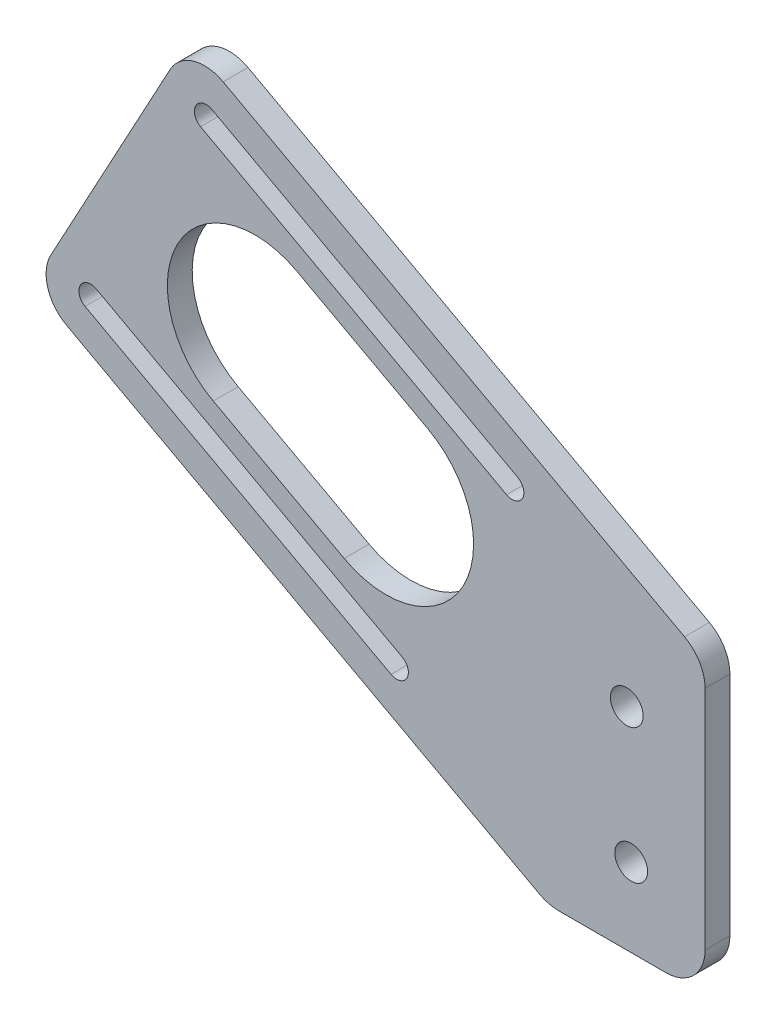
ISO-10303-21;
HEADER;
FILE_DESCRIPTION(('STEP AP214'),'2;1');
FILE_NAME('part.step','',(''),(''),'','','');
FILE_SCHEMA(('AUTOMOTIVE_DESIGN { 1 0 10303 214 1 1 1 1 }'));
ENDSEC;
DATA;
#1=APPLICATION_CONTEXT('core data for automotive mechanical design processes');
#2=APPLICATION_PROTOCOL_DEFINITION('international standard','automotive_design',2000,#1);
#3=PRODUCT_CONTEXT('',#1,'mechanical');
#4=PRODUCT('Part','Part','',(#3));
#5=PRODUCT_RELATED_PRODUCT_CATEGORY('part','',(#4));
#6=PRODUCT_DEFINITION_FORMATION('','',#4);
#7=PRODUCT_DEFINITION_CONTEXT('part definition',#1,'design');
#8=PRODUCT_DEFINITION('design','',#6,#7);
#9=PRODUCT_DEFINITION_SHAPE('','',#8);
#10=(LENGTH_UNIT() NAMED_UNIT(*) SI_UNIT(.MILLI.,.METRE.));
#11=(NAMED_UNIT(*) PLANE_ANGLE_UNIT() SI_UNIT($,.RADIAN.));
#12=(NAMED_UNIT(*) SI_UNIT($,.STERADIAN.) SOLID_ANGLE_UNIT());
#13=UNCERTAINTY_MEASURE_WITH_UNIT(LENGTH_MEASURE(1.E-05),#10,'distance_accuracy_value','');
#14=(GEOMETRIC_REPRESENTATION_CONTEXT(3) GLOBAL_UNCERTAINTY_ASSIGNED_CONTEXT((#13)) GLOBAL_UNIT_ASSIGNED_CONTEXT((#10,
#11,#12)) REPRESENTATION_CONTEXT('',''));
#15=CARTESIAN_POINT('',(0.,0.,0.));
#16=DIRECTION('',(0.,0.,1.));
#17=DIRECTION('',(1.,0.,0.));
#18=AXIS2_PLACEMENT_3D('',#15,#16,#17);
#19=CARTESIAN_POINT('',(0.,0.,3.175));
#20=DIRECTION('',(0.,0.,1.));
#21=DIRECTION('',(1.,0.,0.));
#22=AXIS2_PLACEMENT_3D('',#19,#20,#21);
#23=PLANE('',#22);
#24=CARTESIAN_POINT('',(-53.7276656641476,308.249751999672,3.175));
#25=DIRECTION('',(0.,0.,-1.));
#26=DIRECTION('',(-1.,0.,0.));
#27=AXIS2_PLACEMENT_3D('',#24,#25,#26);
#28=CIRCLE('',#27,1.49999999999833);
#29=CARTESIAN_POINT('',(-54.4419513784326,306.930738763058,3.175));
#30=VERTEX_POINT('',#29);
#31=CARTESIAN_POINT('',(-53.0133799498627,309.568765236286,3.175));
#32=VERTEX_POINT('',#31);
#33=EDGE_CURVE('E243',#30,#32,#28,.T.);
#34=ORIENTED_EDGE('',*,*,#33,.T.);
#35=DIRECTION('',(0.879342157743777,-0.476190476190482,0.));
#36=VECTOR('',#35,1.);
#37=CARTESIAN_POINT('',(-53.0133799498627,309.568765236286,3.175));
#38=LINE('',#37,#36);
#39=CARTESIAN_POINT('',(-13.9266210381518,288.402098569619,3.175));
#40=VERTEX_POINT('',#39);
#41=EDGE_CURVE('E276',#32,#40,#38,.T.);
#42=ORIENTED_EDGE('',*,*,#41,.T.);
#43=CARTESIAN_POINT('',(-14.6409067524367,287.083085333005,3.175));
#44=DIRECTION('',(0.,0.,-1.));
#45=DIRECTION('',(-1.,0.,0.));
#46=AXIS2_PLACEMENT_3D('',#43,#44,#45);
#47=CIRCLE('',#46,1.49999999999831);
#48=CARTESIAN_POINT('',(-15.3551924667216,285.764072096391,3.175));
#49=VERTEX_POINT('',#48);
#50=EDGE_CURVE('E272',#40,#49,#47,.T.);
#51=ORIENTED_EDGE('',*,*,#50,.T.);
#52=DIRECTION('',(0.879342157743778,-0.476190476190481,0.));
#53=VECTOR('',#52,1.);
#54=CARTESIAN_POINT('',(-54.4419513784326,306.930738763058,3.175));
#55=LINE('',#54,#53);
#56=EDGE_CURVE('E270',#30,#49,#55,.T.);
#57=ORIENTED_EDGE('',*,*,#56,.F.);
#58=EDGE_LOOP('',(#34,#42,#51,#57));
#59=FACE_BOUND('',#58,.T.);
#60=CARTESIAN_POINT('',(-47.4844765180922,287.248100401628,3.175));
#61=DIRECTION('',(0.,0.,-1.));
#62=DIRECTION('',(-1.,0.,0.));
#63=AXIS2_PLACEMENT_3D('',#60,#61,#62);
#64=CIRCLE('',#63,11.1999999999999);
#65=CARTESIAN_POINT('',(-52.8178098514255,277.399468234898,3.175));
#66=VERTEX_POINT('',#65);
#67=CARTESIAN_POINT('',(-42.1511431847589,297.096732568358,3.175));
#68=VERTEX_POINT('',#67);
#69=EDGE_CURVE('E311',#66,#68,#64,.T.);
#70=ORIENTED_EDGE('',*,*,#69,.T.);
#71=DIRECTION('',(0.879342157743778,-0.476190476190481,0.));
#72=VECTOR('',#71,1.);
#73=CARTESIAN_POINT('',(-42.1511431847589,297.096732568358,3.175));
#74=LINE('',#73,#72);
#75=CARTESIAN_POINT('',(-25.4301758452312,288.041821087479,3.175));
#76=VERTEX_POINT('',#75);
#77=EDGE_CURVE('E314',#68,#76,#74,.T.);
#78=ORIENTED_EDGE('',*,*,#77,.T.);
#79=CARTESIAN_POINT('',(-30.7635091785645,278.193188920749,3.175));
#80=DIRECTION('',(0.,0.,-1.));
#81=DIRECTION('',(-1.,0.,0.));
#82=AXIS2_PLACEMENT_3D('',#79,#80,#81);
#83=CIRCLE('',#82,11.1999999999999);
#84=CARTESIAN_POINT('',(-36.0968425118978,268.344556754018,3.175));
#85=VERTEX_POINT('',#84);
#86=EDGE_CURVE('E318',#76,#85,#83,.T.);
#87=ORIENTED_EDGE('',*,*,#86,.T.);
#88=DIRECTION('',(0.879342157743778,-0.476190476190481,0.));
#89=VECTOR('',#88,1.);
#90=CARTESIAN_POINT('',(-52.8178098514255,277.399468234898,3.175));
#91=LINE('',#90,#89);
#92=EDGE_CURVE('E321',#66,#85,#91,.T.);
#93=ORIENTED_EDGE('',*,*,#92,.F.);
#94=EDGE_LOOP('',(#70,#78,#87,#93));
#95=FACE_BOUND('',#94,.T.);
#96=CARTESIAN_POINT('',(-1.07552855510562E-13,270.,3.175));
#97=DIRECTION('',(0.,0.,1.));
#98=DIRECTION('',(1.,0.,0.));
#99=AXIS2_PLACEMENT_3D('',#96,#97,#98);
#100=CIRCLE('',#99,2.09500000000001);
#101=CARTESIAN_POINT('',(2.0949999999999,270.,3.175));
#102=VERTEX_POINT('',#101);
#103=EDGE_CURVE('E340',#102,#102,#100,.T.);
#104=ORIENTED_EDGE('',*,*,#103,.F.);
#105=EDGE_LOOP('',(#104));
#106=FACE_BOUND('',#105,.T.);
#107=DIRECTION('',(0.,-1.,0.));
#108=VECTOR('',#107,1.);
#109=CARTESIAN_POINT('',(10.0000000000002,0.,3.175));
#110=LINE('',#109,#108);
#111=CARTESIAN_POINT('',(10.0000000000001,277.021583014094,3.175));
#112=VERTEX_POINT('',#111);
#113=CARTESIAN_POINT('',(10.0000000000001,248.067629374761,3.175));
#114=VERTEX_POINT('',#113);
#115=EDGE_CURVE('E343',#112,#114,#110,.T.);
#116=ORIENTED_EDGE('',*,*,#115,.F.);
#117=CARTESIAN_POINT('',(5.00000000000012,277.021583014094,3.175));
#118=DIRECTION('',(0.,0.,1.));
#119=DIRECTION('',(1.,0.,0.));
#120=AXIS2_PLACEMENT_3D('',#117,#118,#119);
#121=CIRCLE('',#120,5.);
#122=CARTESIAN_POINT('',(7.38095238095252,281.418293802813,3.175));
#123=VERTEX_POINT('',#122);
#124=EDGE_CURVE('E407',#112,#123,#121,.T.);
#125=ORIENTED_EDGE('',*,*,#124,.T.);
#126=DIRECTION('',(-0.879342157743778,0.47619047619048,0.));
#127=VECTOR('',#126,1.);
#128=CARTESIAN_POINT('',(119.51319472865,220.695280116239,3.175));
#129=LINE('',#128,#127);
#130=CARTESIAN_POINT('',(-51.5539510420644,313.333333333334,3.175));
#131=VERTEX_POINT('',#130);
#132=EDGE_CURVE('E347',#123,#131,#129,.T.);
#133=ORIENTED_EDGE('',*,*,#132,.T.);
#134=CARTESIAN_POINT('',(-53.9349034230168,308.936622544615,3.175));
#135=DIRECTION('',(0.,0.,1.));
#136=DIRECTION('',(1.,0.,0.));
#137=AXIS2_PLACEMENT_3D('',#134,#135,#136);
#138=CIRCLE('',#137,5.);
#139=CARTESIAN_POINT('',(-58.3316142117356,311.317574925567,3.175));
#140=VERTEX_POINT('',#139);
#141=EDGE_CURVE('E400',#131,#140,#138,.T.);
#142=ORIENTED_EDGE('',*,*,#141,.T.);
#143=DIRECTION('',(0.47619047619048,0.879342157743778,0.));
#144=VECTOR('',#143,1.);
#145=CARTESIAN_POINT('',(-175.463856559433,95.0190055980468,3.175));
#146=LINE('',#145,#144);
#147=CARTESIAN_POINT('',(-73.569709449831,283.178625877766,3.175));
#148=VERTEX_POINT('',#147);
#149=EDGE_CURVE('E350',#148,#140,#146,.T.);
#150=ORIENTED_EDGE('',*,*,#149,.F.);
#151=CARTESIAN_POINT('',(-69.1729986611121,280.797673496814,3.175));
#152=DIRECTION('',(0.,0.,1.));
#153=DIRECTION('',(1.,0.,0.));
#154=AXIS2_PLACEMENT_3D('',#151,#152,#153);
#155=CIRCLE('',#154,5.);
#156=CARTESIAN_POINT('',(-71.5539510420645,276.400962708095,3.175));
#157=VERTEX_POINT('',#156);
#158=EDGE_CURVE('E402',#148,#157,#155,.T.);
#159=ORIENTED_EDGE('',*,*,#158,.T.);
#160=DIRECTION('',(-0.879342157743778,0.47619047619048,0.));
#161=VECTOR('',#160,1.);
#162=CARTESIAN_POINT('',(99.5131947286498,183.762909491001,3.175));
#163=LINE('',#162,#161);
#164=CARTESIAN_POINT('',(-11.1140450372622,243.670918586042,3.175));
#165=VERTEX_POINT('',#164);
#166=EDGE_CURVE('E353',#165,#157,#163,.T.);
#167=ORIENTED_EDGE('',*,*,#166,.F.);
#168=CARTESIAN_POINT('',(-8.73309265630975,248.067629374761,3.175));
#169=DIRECTION('',(0.,0.,1.));
#170=DIRECTION('',(1.,0.,0.));
#171=AXIS2_PLACEMENT_3D('',#168,#169,#170);
#172=CIRCLE('',#171,5.);
#173=CARTESIAN_POINT('',(-8.73309265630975,243.067629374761,3.175));
#174=VERTEX_POINT('',#173);
#175=EDGE_CURVE('E102',#165,#174,#172,.T.);
#176=ORIENTED_EDGE('',*,*,#175,.T.);
#177=DIRECTION('',(-1.,0.,0.));
#178=VECTOR('',#177,1.);
#179=CARTESIAN_POINT('',(0.,243.067629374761,3.175));
#180=LINE('',#179,#178);
#181=CARTESIAN_POINT('',(5.00000000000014,243.067629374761,3.175));
#182=VERTEX_POINT('',#181);
#183=EDGE_CURVE('E356',#182,#174,#180,.T.);
#184=ORIENTED_EDGE('',*,*,#183,.F.);
#185=CARTESIAN_POINT('',(5.00000000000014,248.067629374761,3.175));
#186=DIRECTION('',(0.,0.,1.));
#187=DIRECTION('',(1.,0.,0.));
#188=AXIS2_PLACEMENT_3D('',#185,#186,#187);
#189=CIRCLE('',#188,5.);
#190=EDGE_CURVE('E405',#182,#114,#189,.T.);
#191=ORIENTED_EDGE('',*,*,#190,.T.);
#192=EDGE_LOOP('',(#116,#125,#133,#142,#150,#159,#167,#176,#184,#191));
#193=FACE_BOUND('',#192,.T.);
#194=CARTESIAN_POINT('',(0.569659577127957,253.067629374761,3.175));
#195=DIRECTION('',(0.,0.,1.));
#196=DIRECTION('',(1.,0.,0.));
#197=AXIS2_PLACEMENT_3D('',#194,#195,#196);
#198=CIRCLE('',#197,2.095);
#199=CARTESIAN_POINT('',(2.66465957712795,253.067629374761,3.175));
#200=VERTEX_POINT('',#199);
#201=EDGE_CURVE('E358',#200,#200,#198,.T.);
#202=ORIENTED_EDGE('',*,*,#201,.F.);
#203=EDGE_LOOP('',(#202));
#204=FACE_BOUND('',#203,.T.);
#205=DIRECTION('',(0.879342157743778,-0.476190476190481,0.));
#206=VECTOR('',#205,1.);
#207=CARTESIAN_POINT('',(-69.1987993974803,279.680469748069,3.175));
#208=LINE('',#207,#206);
#209=CARTESIAN_POINT('',(-69.1987993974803,279.680469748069,3.175));
#210=VERTEX_POINT('',#209);
#211=CARTESIAN_POINT('',(-30.1120404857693,258.513803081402,3.175));
#212=VERTEX_POINT('',#211);
#213=EDGE_CURVE('E308',#210,#212,#208,.T.);
#214=ORIENTED_EDGE('',*,*,#213,.F.);
#215=CARTESIAN_POINT('',(-68.4845136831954,280.999482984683,3.175));
#216=DIRECTION('',(0.,0.,1.));
#217=DIRECTION('',(1.,0.,0.));
#218=AXIS2_PLACEMENT_3D('',#215,#216,#217);
#219=CIRCLE('',#218,1.49999999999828);
#220=CARTESIAN_POINT('',(-67.7702279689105,282.318496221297,3.175));
#221=VERTEX_POINT('',#220);
#222=EDGE_CURVE('E295',#221,#210,#219,.T.);
#223=ORIENTED_EDGE('',*,*,#222,.F.);
#224=DIRECTION('',(0.879342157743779,-0.476190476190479,0.));
#225=VECTOR('',#224,1.);
#226=CARTESIAN_POINT('',(-67.7702279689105,282.318496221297,3.175));
#227=LINE('',#226,#225);
#228=CARTESIAN_POINT('',(-28.6834690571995,261.15182955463,3.175));
#229=VERTEX_POINT('',#228);
#230=EDGE_CURVE('E290',#221,#229,#227,.T.);
#231=ORIENTED_EDGE('',*,*,#230,.T.);
#232=CARTESIAN_POINT('',(-29.3977547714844,259.832816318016,3.175));
#233=DIRECTION('',(0.,0.,1.));
#234=DIRECTION('',(1.,0.,0.));
#235=AXIS2_PLACEMENT_3D('',#232,#233,#234);
#236=CIRCLE('',#235,1.49999999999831);
#237=EDGE_CURVE('E305',#212,#229,#236,.T.);
#238=ORIENTED_EDGE('',*,*,#237,.F.);
#239=EDGE_LOOP('',(#214,#223,#231,#238));
#240=FACE_BOUND('',#239,.T.);
#241=ADVANCED_FACE('F87',(#59,#95,#106,#193,#204,#240),#23,.T.);
#242=CARTESIAN_POINT('',(0.,0.,0.));
#243=DIRECTION('',(0.,0.,1.));
#244=DIRECTION('',(1.,0.,0.));
#245=AXIS2_PLACEMENT_3D('',#242,#243,#244);
#246=PLANE('',#245);
#247=CARTESIAN_POINT('',(0.569659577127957,253.067629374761,0.));
#248=DIRECTION('',(0.,0.,1.));
#249=DIRECTION('',(1.,0.,0.));
#250=AXIS2_PLACEMENT_3D('',#247,#248,#249);
#251=CIRCLE('',#250,2.095);
#252=CARTESIAN_POINT('',(2.66465957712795,253.067629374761,0.));
#253=VERTEX_POINT('',#252);
#254=EDGE_CURVE('E344',#253,#253,#251,.T.);
#255=ORIENTED_EDGE('',*,*,#254,.T.);
#256=EDGE_LOOP('',(#255));
#257=FACE_BOUND('',#256,.T.);
#258=DIRECTION('',(-0.879342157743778,0.47619047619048,0.));
#259=VECTOR('',#258,1.);
#260=CARTESIAN_POINT('',(119.51319472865,220.695280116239,0.));
#261=LINE('',#260,#259);
#262=CARTESIAN_POINT('',(7.38095238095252,281.418293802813,0.));
#263=VERTEX_POINT('',#262);
#264=CARTESIAN_POINT('',(-51.5539510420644,313.333333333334,0.));
#265=VERTEX_POINT('',#264);
#266=EDGE_CURVE('E367',#263,#265,#261,.T.);
#267=ORIENTED_EDGE('',*,*,#266,.F.);
#268=CARTESIAN_POINT('',(5.00000000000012,277.021583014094,0.));
#269=DIRECTION('',(0.,0.,1.));
#270=DIRECTION('',(1.,0.,0.));
#271=AXIS2_PLACEMENT_3D('',#268,#269,#270);
#272=CIRCLE('',#271,5.);
#273=CARTESIAN_POINT('',(10.0000000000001,277.021583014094,0.));
#274=VERTEX_POINT('',#273);
#275=EDGE_CURVE('E393',#263,#274,#272,.F.);
#276=ORIENTED_EDGE('',*,*,#275,.T.);
#277=DIRECTION('',(0.,-1.,0.));
#278=VECTOR('',#277,1.);
#279=CARTESIAN_POINT('',(10.0000000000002,0.,0.));
#280=LINE('',#279,#278);
#281=CARTESIAN_POINT('',(10.0000000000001,248.067629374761,0.));
#282=VERTEX_POINT('',#281);
#283=EDGE_CURVE('E364',#274,#282,#280,.T.);
#284=ORIENTED_EDGE('',*,*,#283,.T.);
#285=CARTESIAN_POINT('',(5.00000000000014,248.067629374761,0.));
#286=DIRECTION('',(0.,0.,1.));
#287=DIRECTION('',(1.,0.,0.));
#288=AXIS2_PLACEMENT_3D('',#285,#286,#287);
#289=CIRCLE('',#288,5.);
#290=CARTESIAN_POINT('',(5.00000000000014,243.067629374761,0.));
#291=VERTEX_POINT('',#290);
#292=EDGE_CURVE('E391',#282,#291,#289,.F.);
#293=ORIENTED_EDGE('',*,*,#292,.T.);
#294=DIRECTION('',(-1.,0.,0.));
#295=VECTOR('',#294,1.);
#296=CARTESIAN_POINT('',(0.,243.067629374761,0.));
#297=LINE('',#296,#295);
#298=CARTESIAN_POINT('',(-8.73309265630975,243.067629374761,0.));
#299=VERTEX_POINT('',#298);
#300=EDGE_CURVE('E376',#291,#299,#297,.T.);
#301=ORIENTED_EDGE('',*,*,#300,.T.);
#302=CARTESIAN_POINT('',(-8.73309265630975,248.067629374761,0.));
#303=DIRECTION('',(0.,0.,1.));
#304=DIRECTION('',(1.,0.,0.));
#305=AXIS2_PLACEMENT_3D('',#302,#303,#304);
#306=CIRCLE('',#305,5.);
#307=CARTESIAN_POINT('',(-11.1140450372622,243.670918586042,0.));
#308=VERTEX_POINT('',#307);
#309=EDGE_CURVE('E389',#299,#308,#306,.F.);
#310=ORIENTED_EDGE('',*,*,#309,.T.);
#311=DIRECTION('',(-0.879342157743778,0.47619047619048,0.));
#312=VECTOR('',#311,1.);
#313=CARTESIAN_POINT('',(99.5131947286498,183.762909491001,0.));
#314=LINE('',#313,#312);
#315=CARTESIAN_POINT('',(-71.5539510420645,276.400962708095,0.));
#316=VERTEX_POINT('',#315);
#317=EDGE_CURVE('E373',#308,#316,#314,.T.);
#318=ORIENTED_EDGE('',*,*,#317,.T.);
#319=CARTESIAN_POINT('',(-69.1729986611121,280.797673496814,0.));
#320=DIRECTION('',(0.,0.,1.));
#321=DIRECTION('',(1.,0.,0.));
#322=AXIS2_PLACEMENT_3D('',#319,#320,#321);
#323=CIRCLE('',#322,5.);
#324=CARTESIAN_POINT('',(-73.569709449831,283.178625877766,0.));
#325=VERTEX_POINT('',#324);
#326=EDGE_CURVE('E387',#316,#325,#323,.F.);
#327=ORIENTED_EDGE('',*,*,#326,.T.);
#328=DIRECTION('',(0.47619047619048,0.879342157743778,0.));
#329=VECTOR('',#328,1.);
#330=CARTESIAN_POINT('',(-175.463856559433,95.0190055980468,0.));
#331=LINE('',#330,#329);
#332=CARTESIAN_POINT('',(-58.3316142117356,311.317574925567,0.));
#333=VERTEX_POINT('',#332);
#334=EDGE_CURVE('E370',#325,#333,#331,.T.);
#335=ORIENTED_EDGE('',*,*,#334,.T.);
#336=CARTESIAN_POINT('',(-53.9349034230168,308.936622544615,0.));
#337=DIRECTION('',(0.,0.,1.));
#338=DIRECTION('',(1.,0.,0.));
#339=AXIS2_PLACEMENT_3D('',#336,#337,#338);
#340=CIRCLE('',#339,5.);
#341=EDGE_CURVE('E385',#333,#265,#340,.F.);
#342=ORIENTED_EDGE('',*,*,#341,.T.);
#343=EDGE_LOOP('',(#267,#276,#284,#293,#301,#310,#318,#327,#335,#342));
#344=FACE_BOUND('',#343,.T.);
#345=CARTESIAN_POINT('',(-1.07552855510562E-13,270.,0.));
#346=DIRECTION('',(0.,0.,1.));
#347=DIRECTION('',(1.,0.,0.));
#348=AXIS2_PLACEMENT_3D('',#345,#346,#347);
#349=CIRCLE('',#348,2.09500000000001);
#350=CARTESIAN_POINT('',(2.0949999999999,270.,0.));
#351=VERTEX_POINT('',#350);
#352=EDGE_CURVE('E333',#351,#351,#349,.T.);
#353=ORIENTED_EDGE('',*,*,#352,.T.);
#354=EDGE_LOOP('',(#353));
#355=FACE_BOUND('',#354,.T.);
#356=DIRECTION('',(0.879342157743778,-0.476190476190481,0.));
#357=VECTOR('',#356,1.);
#358=CARTESIAN_POINT('',(-42.1511431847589,297.096732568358,0.));
#359=LINE('',#358,#357);
#360=CARTESIAN_POINT('',(-42.1511431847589,297.096732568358,0.));
#361=VERTEX_POINT('',#360);
#362=CARTESIAN_POINT('',(-25.4301758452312,288.041821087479,0.));
#363=VERTEX_POINT('',#362);
#364=EDGE_CURVE('E265',#361,#363,#359,.T.);
#365=ORIENTED_EDGE('',*,*,#364,.F.);
#366=CARTESIAN_POINT('',(-47.4844765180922,287.248100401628,0.));
#367=DIRECTION('',(0.,0.,-1.));
#368=DIRECTION('',(-1.,0.,0.));
#369=AXIS2_PLACEMENT_3D('',#366,#367,#368);
#370=CIRCLE('',#369,11.1999999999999);
#371=CARTESIAN_POINT('',(-52.8178098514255,277.399468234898,0.));
#372=VERTEX_POINT('',#371);
#373=EDGE_CURVE('E263',#372,#361,#370,.T.);
#374=ORIENTED_EDGE('',*,*,#373,.F.);
#375=DIRECTION('',(0.879342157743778,-0.476190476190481,0.));
#376=VECTOR('',#375,1.);
#377=CARTESIAN_POINT('',(-52.8178098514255,277.399468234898,0.));
#378=LINE('',#377,#376);
#379=CARTESIAN_POINT('',(-36.0968425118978,268.344556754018,0.));
#380=VERTEX_POINT('',#379);
#381=EDGE_CURVE('E315',#372,#380,#378,.T.);
#382=ORIENTED_EDGE('',*,*,#381,.T.);
#383=CARTESIAN_POINT('',(-30.7635091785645,278.193188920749,0.));
#384=DIRECTION('',(0.,0.,-1.));
#385=DIRECTION('',(-1.,0.,0.));
#386=AXIS2_PLACEMENT_3D('',#383,#384,#385);
#387=CIRCLE('',#386,11.1999999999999);
#388=EDGE_CURVE('E326',#363,#380,#387,.T.);
#389=ORIENTED_EDGE('',*,*,#388,.F.);
#390=EDGE_LOOP('',(#365,#374,#382,#389));
#391=FACE_BOUND('',#390,.T.);
#392=DIRECTION('',(0.879342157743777,-0.476190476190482,0.));
#393=VECTOR('',#392,1.);
#394=CARTESIAN_POINT('',(-53.0133799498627,309.568765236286,0.));
#395=LINE('',#394,#393);
#396=CARTESIAN_POINT('',(-53.0133799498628,309.568765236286,0.));
#397=VERTEX_POINT('',#396);
#398=CARTESIAN_POINT('',(-13.9266210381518,288.402098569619,0.));
#399=VERTEX_POINT('',#398);
#400=EDGE_CURVE('E262',#397,#399,#395,.T.);
#401=ORIENTED_EDGE('',*,*,#400,.F.);
#402=CARTESIAN_POINT('',(-53.7276656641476,308.249751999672,0.));
#403=DIRECTION('',(0.,0.,-1.));
#404=DIRECTION('',(-1.,0.,0.));
#405=AXIS2_PLACEMENT_3D('',#402,#403,#404);
#406=CIRCLE('',#405,1.49999999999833);
#407=CARTESIAN_POINT('',(-54.4419513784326,306.930738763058,0.));
#408=VERTEX_POINT('',#407);
#409=EDGE_CURVE('E240',#408,#397,#406,.T.);
#410=ORIENTED_EDGE('',*,*,#409,.F.);
#411=DIRECTION('',(0.879342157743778,-0.476190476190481,0.));
#412=VECTOR('',#411,1.);
#413=CARTESIAN_POINT('',(-54.4419513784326,306.930738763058,0.));
#414=LINE('',#413,#412);
#415=CARTESIAN_POINT('',(-15.3551924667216,285.764072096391,0.));
#416=VERTEX_POINT('',#415);
#417=EDGE_CURVE('E250',#408,#416,#414,.T.);
#418=ORIENTED_EDGE('',*,*,#417,.T.);
#419=CARTESIAN_POINT('',(-14.6409067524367,287.083085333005,0.));
#420=DIRECTION('',(0.,0.,-1.));
#421=DIRECTION('',(-1.,0.,0.));
#422=AXIS2_PLACEMENT_3D('',#419,#420,#421);
#423=CIRCLE('',#422,1.49999999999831);
#424=EDGE_CURVE('E256',#399,#416,#423,.T.);
#425=ORIENTED_EDGE('',*,*,#424,.F.);
#426=EDGE_LOOP('',(#401,#410,#418,#425));
#427=FACE_BOUND('',#426,.T.);
#428=CARTESIAN_POINT('',(-68.4845136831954,280.999482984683,0.));
#429=DIRECTION('',(0.,0.,1.));
#430=DIRECTION('',(1.,0.,0.));
#431=AXIS2_PLACEMENT_3D('',#428,#429,#430);
#432=CIRCLE('',#431,1.49999999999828);
#433=CARTESIAN_POINT('',(-67.7702279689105,282.318496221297,0.));
#434=VERTEX_POINT('',#433);
#435=CARTESIAN_POINT('',(-69.1987993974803,279.680469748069,0.));
#436=VERTEX_POINT('',#435);
#437=EDGE_CURVE('E247',#434,#436,#432,.T.);
#438=ORIENTED_EDGE('',*,*,#437,.T.);
#439=DIRECTION('',(0.879342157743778,-0.476190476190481,0.));
#440=VECTOR('',#439,1.);
#441=CARTESIAN_POINT('',(-69.1987993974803,279.680469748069,0.));
#442=LINE('',#441,#440);
#443=CARTESIAN_POINT('',(-30.1120404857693,258.513803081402,0.));
#444=VERTEX_POINT('',#443);
#445=EDGE_CURVE('E298',#436,#444,#442,.T.);
#446=ORIENTED_EDGE('',*,*,#445,.T.);
#447=CARTESIAN_POINT('',(-29.3977547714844,259.832816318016,0.));
#448=DIRECTION('',(0.,0.,1.));
#449=DIRECTION('',(1.,0.,0.));
#450=AXIS2_PLACEMENT_3D('',#447,#448,#449);
#451=CIRCLE('',#450,1.49999999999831);
#452=CARTESIAN_POINT('',(-28.6834690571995,261.15182955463,0.));
#453=VERTEX_POINT('',#452);
#454=EDGE_CURVE('E294',#444,#453,#451,.T.);
#455=ORIENTED_EDGE('',*,*,#454,.T.);
#456=DIRECTION('',(0.879342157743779,-0.476190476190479,0.));
#457=VECTOR('',#456,1.);
#458=CARTESIAN_POINT('',(-67.7702279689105,282.318496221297,0.));
#459=LINE('',#458,#457);
#460=EDGE_CURVE('E291',#434,#453,#459,.T.);
#461=ORIENTED_EDGE('',*,*,#460,.F.);
#462=EDGE_LOOP('',(#438,#446,#455,#461));
#463=FACE_BOUND('',#462,.T.);
#464=ADVANCED_FACE('F259',(#257,#344,#355,#391,#427,#463),#246,.F.);
#465=CARTESIAN_POINT('',(10.0000000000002,0.,3.175));
#466=DIRECTION('',(1.,0.,0.));
#467=DIRECTION('',(0.,1.,0.));
#468=AXIS2_PLACEMENT_3D('',#465,#466,#467);
#469=PLANE('',#468);
#470=ORIENTED_EDGE('',*,*,#283,.F.);
#471=DIRECTION('',(0.,0.,-1.));
#472=VECTOR('',#471,1.);
#473=CARTESIAN_POINT('',(10.0000000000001,277.021583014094,3.175));
#474=LINE('',#473,#472);
#475=EDGE_CURVE('E398',#274,#112,#474,.F.);
#476=ORIENTED_EDGE('',*,*,#475,.T.);
#477=ORIENTED_EDGE('',*,*,#115,.T.);
#478=DIRECTION('',(0.,0.,-1.));
#479=VECTOR('',#478,1.);
#480=CARTESIAN_POINT('',(10.0000000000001,248.067629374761,3.175));
#481=LINE('',#480,#479);
#482=EDGE_CURVE('E395',#114,#282,#481,.T.);
#483=ORIENTED_EDGE('',*,*,#482,.T.);
#484=EDGE_LOOP('',(#470,#476,#477,#483));
#485=FACE_BOUND('',#484,.T.);
#486=ADVANCED_FACE('F449',(#485),#469,.T.);
#487=CARTESIAN_POINT('',(119.51319472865,220.695280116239,3.175));
#488=DIRECTION('',(-0.47619047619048,-0.879342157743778,0.));
#489=DIRECTION('',(0.879342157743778,-0.47619047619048,0.));
#490=AXIS2_PLACEMENT_3D('',#487,#488,#489);
#491=PLANE('',#490);
#492=ORIENTED_EDGE('',*,*,#132,.F.);
#493=DIRECTION('',(0.,0.,-1.));
#494=VECTOR('',#493,1.);
#495=CARTESIAN_POINT('',(7.38095238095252,281.418293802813,0.));
#496=LINE('',#495,#494);
#497=EDGE_CURVE('E382',#123,#263,#496,.T.);
#498=ORIENTED_EDGE('',*,*,#497,.T.);
#499=ORIENTED_EDGE('',*,*,#266,.T.);
#500=DIRECTION('',(0.,0.,-1.));
#501=VECTOR('',#500,1.);
#502=CARTESIAN_POINT('',(-51.5539510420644,313.333333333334,3.175));
#503=LINE('',#502,#501);
#504=EDGE_CURVE('E361',#265,#131,#503,.F.);
#505=ORIENTED_EDGE('',*,*,#504,.T.);
#506=EDGE_LOOP('',(#492,#498,#499,#505));
#507=FACE_BOUND('',#506,.T.);
#508=ADVANCED_FACE('F457',(#507),#491,.F.);
#509=CARTESIAN_POINT('',(-175.463856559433,95.0190055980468,3.175));
#510=DIRECTION('',(-0.879342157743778,0.47619047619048,0.));
#511=DIRECTION('',(-0.47619047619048,-0.879342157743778,0.));
#512=AXIS2_PLACEMENT_3D('',#509,#510,#511);
#513=PLANE('',#512);
#514=ORIENTED_EDGE('',*,*,#334,.F.);
#515=DIRECTION('',(0.,0.,-1.));
#516=VECTOR('',#515,1.);
#517=CARTESIAN_POINT('',(-73.5697094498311,283.178625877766,3.175));
#518=LINE('',#517,#516);
#519=EDGE_CURVE('E12',#325,#148,#518,.F.);
#520=ORIENTED_EDGE('',*,*,#519,.T.);
#521=ORIENTED_EDGE('',*,*,#149,.T.);
#522=DIRECTION('',(0.,0.,-1.));
#523=VECTOR('',#522,1.);
#524=CARTESIAN_POINT('',(-58.3316142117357,311.317574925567,0.));
#525=LINE('',#524,#523);
#526=EDGE_CURVE('E95',#140,#333,#525,.T.);
#527=ORIENTED_EDGE('',*,*,#526,.T.);
#528=EDGE_LOOP('',(#514,#520,#521,#527));
#529=FACE_BOUND('',#528,.T.);
#530=ADVANCED_FACE('F421',(#529),#513,.T.);
#531=CARTESIAN_POINT('',(99.5131947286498,183.762909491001,3.175));
#532=DIRECTION('',(-0.47619047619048,-0.879342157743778,0.));
#533=DIRECTION('',(0.879342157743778,-0.47619047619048,0.));
#534=AXIS2_PLACEMENT_3D('',#531,#532,#533);
#535=PLANE('',#534);
#536=ORIENTED_EDGE('',*,*,#317,.F.);
#537=DIRECTION('',(0.,0.,-1.));
#538=VECTOR('',#537,1.);
#539=CARTESIAN_POINT('',(-11.1140450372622,243.670918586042,3.175));
#540=LINE('',#539,#538);
#541=EDGE_CURVE('E416',#308,#165,#540,.F.);
#542=ORIENTED_EDGE('',*,*,#541,.T.);
#543=ORIENTED_EDGE('',*,*,#166,.T.);
#544=DIRECTION('',(0.,0.,-1.));
#545=VECTOR('',#544,1.);
#546=CARTESIAN_POINT('',(-71.5539510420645,276.400962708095,3.175));
#547=LINE('',#546,#545);
#548=EDGE_CURVE('E413',#157,#316,#547,.T.);
#549=ORIENTED_EDGE('',*,*,#548,.T.);
#550=EDGE_LOOP('',(#536,#542,#543,#549));
#551=FACE_BOUND('',#550,.T.);
#552=ADVANCED_FACE('F435',(#551),#535,.T.);
#553=CARTESIAN_POINT('',(0.,243.067629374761,3.175));
#554=DIRECTION('',(0.,-1.,0.));
#555=DIRECTION('',(0.,0.,-1.));
#556=AXIS2_PLACEMENT_3D('',#553,#554,#555);
#557=PLANE('',#556);
#558=ORIENTED_EDGE('',*,*,#300,.F.);
#559=DIRECTION('',(0.,0.,-1.));
#560=VECTOR('',#559,1.);
#561=CARTESIAN_POINT('',(5.00000000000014,243.067629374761,3.175));
#562=LINE('',#561,#560);
#563=EDGE_CURVE('E109',#291,#182,#562,.F.);
#564=ORIENTED_EDGE('',*,*,#563,.T.);
#565=ORIENTED_EDGE('',*,*,#183,.T.);
#566=DIRECTION('',(0.,0.,-1.));
#567=VECTOR('',#566,1.);
#568=CARTESIAN_POINT('',(-8.73309265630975,243.067629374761,3.175));
#569=LINE('',#568,#567);
#570=EDGE_CURVE('E409',#174,#299,#569,.T.);
#571=ORIENTED_EDGE('',*,*,#570,.T.);
#572=EDGE_LOOP('',(#558,#564,#565,#571));
#573=FACE_BOUND('',#572,.T.);
#574=ADVANCED_FACE('F442',(#573),#557,.T.);
#575=CARTESIAN_POINT('',(-1.07552855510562E-13,270.,3.175));
#576=DIRECTION('',(0.,0.,-1.));
#577=DIRECTION('',(-1.,0.,0.));
#578=AXIS2_PLACEMENT_3D('',#575,#576,#577);
#579=CYLINDRICAL_SURFACE('',#578,2.09500000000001);
#580=ORIENTED_EDGE('',*,*,#103,.T.);
#581=EDGE_LOOP('',(#580));
#582=FACE_BOUND('',#581,.T.);
#583=ORIENTED_EDGE('',*,*,#352,.F.);
#584=EDGE_LOOP('',(#583));
#585=FACE_BOUND('',#584,.T.);
#586=ADVANCED_FACE('F480',(#582,#585),#579,.F.);
#587=CARTESIAN_POINT('',(0.569659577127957,253.067629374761,3.175));
#588=DIRECTION('',(0.,0.,-1.));
#589=DIRECTION('',(-1.,0.,0.));
#590=AXIS2_PLACEMENT_3D('',#587,#588,#589);
#591=CYLINDRICAL_SURFACE('',#590,2.095);
#592=ORIENTED_EDGE('',*,*,#201,.T.);
#593=EDGE_LOOP('',(#592));
#594=FACE_BOUND('',#593,.T.);
#595=ORIENTED_EDGE('',*,*,#254,.F.);
#596=EDGE_LOOP('',(#595));
#597=FACE_BOUND('',#596,.T.);
#598=ADVANCED_FACE('F477',(#594,#597),#591,.F.);
#599=CARTESIAN_POINT('',(-47.4844765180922,287.248100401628,3.175));
#600=DIRECTION('',(0.,0.,-1.));
#601=DIRECTION('',(-1.,0.,0.));
#602=AXIS2_PLACEMENT_3D('',#599,#600,#601);
#603=CYLINDRICAL_SURFACE('',#602,11.1999999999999);
#604=ORIENTED_EDGE('',*,*,#373,.T.);
#605=DIRECTION('',(0.,0.,-1.));
#606=VECTOR('',#605,1.);
#607=CARTESIAN_POINT('',(-42.1511431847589,297.096732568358,3.175));
#608=LINE('',#607,#606);
#609=EDGE_CURVE('E322',#68,#361,#608,.T.);
#610=ORIENTED_EDGE('',*,*,#609,.F.);
#611=ORIENTED_EDGE('',*,*,#69,.F.);
#612=DIRECTION('',(0.,0.,-1.));
#613=VECTOR('',#612,1.);
#614=CARTESIAN_POINT('',(-52.8178098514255,277.399468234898,3.175));
#615=LINE('',#614,#613);
#616=EDGE_CURVE('E331',#66,#372,#615,.T.);
#617=ORIENTED_EDGE('',*,*,#616,.T.);
#618=EDGE_LOOP('',(#604,#610,#611,#617));
#619=FACE_BOUND('',#618,.T.);
#620=ADVANCED_FACE('F474',(#619),#603,.F.);
#621=CARTESIAN_POINT('',(-52.8178098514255,277.399468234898,3.175));
#622=DIRECTION('',(0.476190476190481,0.879342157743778,0.));
#623=DIRECTION('',(-0.879342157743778,0.476190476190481,0.));
#624=AXIS2_PLACEMENT_3D('',#621,#622,#623);
#625=PLANE('',#624);
#626=ORIENTED_EDGE('',*,*,#381,.F.);
#627=ORIENTED_EDGE('',*,*,#616,.F.);
#628=ORIENTED_EDGE('',*,*,#92,.T.);
#629=DIRECTION('',(0.,0.,-1.));
#630=VECTOR('',#629,1.);
#631=CARTESIAN_POINT('',(-36.0968425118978,268.344556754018,3.175));
#632=LINE('',#631,#630);
#633=EDGE_CURVE('E334',#85,#380,#632,.T.);
#634=ORIENTED_EDGE('',*,*,#633,.T.);
#635=EDGE_LOOP('',(#626,#627,#628,#634));
#636=FACE_BOUND('',#635,.T.);
#637=ADVANCED_FACE('F608',(#636),#625,.T.);
#638=CARTESIAN_POINT('',(-30.7635091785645,278.193188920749,3.175));
#639=DIRECTION('',(0.,0.,-1.));
#640=DIRECTION('',(-1.,0.,0.));
#641=AXIS2_PLACEMENT_3D('',#638,#639,#640);
#642=CYLINDRICAL_SURFACE('',#641,11.1999999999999);
#643=ORIENTED_EDGE('',*,*,#388,.T.);
#644=ORIENTED_EDGE('',*,*,#633,.F.);
#645=ORIENTED_EDGE('',*,*,#86,.F.);
#646=DIRECTION('',(0.,0.,-1.));
#647=VECTOR('',#646,1.);
#648=CARTESIAN_POINT('',(-25.4301758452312,288.041821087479,3.175));
#649=LINE('',#648,#647);
#650=EDGE_CURVE('E336',#76,#363,#649,.T.);
#651=ORIENTED_EDGE('',*,*,#650,.T.);
#652=EDGE_LOOP('',(#643,#644,#645,#651));
#653=FACE_BOUND('',#652,.T.);
#654=ADVANCED_FACE('F600',(#653),#642,.F.);
#655=CARTESIAN_POINT('',(-42.1511431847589,297.096732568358,3.175));
#656=DIRECTION('',(0.476190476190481,0.879342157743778,0.));
#657=DIRECTION('',(-0.879342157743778,0.476190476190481,0.));
#658=AXIS2_PLACEMENT_3D('',#655,#656,#657);
#659=PLANE('',#658);
#660=ORIENTED_EDGE('',*,*,#364,.T.);
#661=ORIENTED_EDGE('',*,*,#650,.F.);
#662=ORIENTED_EDGE('',*,*,#77,.F.);
#663=ORIENTED_EDGE('',*,*,#609,.T.);
#664=EDGE_LOOP('',(#660,#661,#662,#663));
#665=FACE_BOUND('',#664,.T.);
#666=ADVANCED_FACE('F592',(#665),#659,.F.);
#667=CARTESIAN_POINT('',(-53.7276656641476,308.249751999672,3.175));
#668=DIRECTION('',(0.,0.,-1.));
#669=DIRECTION('',(-1.,0.,0.));
#670=AXIS2_PLACEMENT_3D('',#667,#668,#669);
#671=CYLINDRICAL_SURFACE('',#670,1.49999999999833);
#672=ORIENTED_EDGE('',*,*,#409,.T.);
#673=DIRECTION('',(0.,0.,-1.));
#674=VECTOR('',#673,1.);
#675=CARTESIAN_POINT('',(-53.0133799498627,309.568765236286,3.175));
#676=LINE('',#675,#674);
#677=EDGE_CURVE('E273',#32,#397,#676,.T.);
#678=ORIENTED_EDGE('',*,*,#677,.F.);
#679=ORIENTED_EDGE('',*,*,#33,.F.);
#680=DIRECTION('',(0.,0.,-1.));
#681=VECTOR('',#680,1.);
#682=CARTESIAN_POINT('',(-54.4419513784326,306.930738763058,3.175));
#683=LINE('',#682,#681);
#684=EDGE_CURVE('E236',#30,#408,#683,.T.);
#685=ORIENTED_EDGE('',*,*,#684,.T.);
#686=EDGE_LOOP('',(#672,#678,#679,#685));
#687=FACE_BOUND('',#686,.T.);
#688=ADVANCED_FACE('F238',(#687),#671,.F.);
#689=CARTESIAN_POINT('',(-54.4419513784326,306.930738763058,3.175));
#690=DIRECTION('',(0.476190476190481,0.879342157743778,0.));
#691=DIRECTION('',(-0.879342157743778,0.476190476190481,0.));
#692=AXIS2_PLACEMENT_3D('',#689,#690,#691);
#693=PLANE('',#692);
#694=ORIENTED_EDGE('',*,*,#417,.F.);
#695=ORIENTED_EDGE('',*,*,#684,.F.);
#696=ORIENTED_EDGE('',*,*,#56,.T.);
#697=DIRECTION('',(0.,0.,-1.));
#698=VECTOR('',#697,1.);
#699=CARTESIAN_POINT('',(-15.3551924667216,285.764072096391,3.175));
#700=LINE('',#699,#698);
#701=EDGE_CURVE('E246',#49,#416,#700,.T.);
#702=ORIENTED_EDGE('',*,*,#701,.T.);
#703=EDGE_LOOP('',(#694,#695,#696,#702));
#704=FACE_BOUND('',#703,.T.);
#705=ADVANCED_FACE('F251',(#704),#693,.T.);
#706=CARTESIAN_POINT('',(-14.6409067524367,287.083085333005,3.175));
#707=DIRECTION('',(0.,0.,-1.));
#708=DIRECTION('',(-1.,0.,0.));
#709=AXIS2_PLACEMENT_3D('',#706,#707,#708);
#710=CYLINDRICAL_SURFACE('',#709,1.49999999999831);
#711=ORIENTED_EDGE('',*,*,#424,.T.);
#712=ORIENTED_EDGE('',*,*,#701,.F.);
#713=ORIENTED_EDGE('',*,*,#50,.F.);
#714=DIRECTION('',(0.,0.,-1.));
#715=VECTOR('',#714,1.);
#716=CARTESIAN_POINT('',(-13.9266210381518,288.402098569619,3.175));
#717=LINE('',#716,#715);
#718=EDGE_CURVE('E719',#40,#399,#717,.T.);
#719=ORIENTED_EDGE('',*,*,#718,.T.);
#720=EDGE_LOOP('',(#711,#712,#713,#719));
#721=FACE_BOUND('',#720,.T.);
#722=ADVANCED_FACE('F568',(#721),#710,.F.);
#723=CARTESIAN_POINT('',(-53.0133799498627,309.568765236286,3.175));
#724=DIRECTION('',(0.476190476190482,0.879342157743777,0.));
#725=DIRECTION('',(-0.879342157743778,0.476190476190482,0.));
#726=AXIS2_PLACEMENT_3D('',#723,#724,#725);
#727=PLANE('',#726);
#728=ORIENTED_EDGE('',*,*,#400,.T.);
#729=ORIENTED_EDGE('',*,*,#718,.F.);
#730=ORIENTED_EDGE('',*,*,#41,.F.);
#731=ORIENTED_EDGE('',*,*,#677,.T.);
#732=EDGE_LOOP('',(#728,#729,#730,#731));
#733=FACE_BOUND('',#732,.T.);
#734=ADVANCED_FACE('F559',(#733),#727,.F.);
#735=CARTESIAN_POINT('',(-68.4845136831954,280.999482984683,3.175));
#736=DIRECTION('',(0.,0.,-1.));
#737=DIRECTION('',(-1.,0.,0.));
#738=AXIS2_PLACEMENT_3D('',#735,#736,#737);
#739=CYLINDRICAL_SURFACE('',#738,1.49999999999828);
#740=ORIENTED_EDGE('',*,*,#437,.F.);
#741=DIRECTION('',(0.,0.,-1.));
#742=VECTOR('',#741,1.);
#743=CARTESIAN_POINT('',(-67.7702279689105,282.318496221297,3.175));
#744=LINE('',#743,#742);
#745=EDGE_CURVE('E287',#221,#434,#744,.T.);
#746=ORIENTED_EDGE('',*,*,#745,.F.);
#747=ORIENTED_EDGE('',*,*,#222,.T.);
#748=DIRECTION('',(0.,0.,-1.));
#749=VECTOR('',#748,1.);
#750=CARTESIAN_POINT('',(-69.1987993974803,279.680469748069,3.175));
#751=LINE('',#750,#749);
#752=EDGE_CURVE('E280',#210,#436,#751,.T.);
#753=ORIENTED_EDGE('',*,*,#752,.T.);
#754=EDGE_LOOP('',(#740,#746,#747,#753));
#755=FACE_BOUND('',#754,.T.);
#756=ADVANCED_FACE('F550',(#755),#739,.F.);
#757=CARTESIAN_POINT('',(-69.1987993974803,279.680469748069,3.175));
#758=DIRECTION('',(0.476190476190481,0.879342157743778,0.));
#759=DIRECTION('',(-0.879342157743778,0.476190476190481,0.));
#760=AXIS2_PLACEMENT_3D('',#757,#758,#759);
#761=PLANE('',#760);
#762=ORIENTED_EDGE('',*,*,#445,.F.);
#763=ORIENTED_EDGE('',*,*,#752,.F.);
#764=ORIENTED_EDGE('',*,*,#213,.T.);
#765=DIRECTION('',(0.,0.,-1.));
#766=VECTOR('',#765,1.);
#767=CARTESIAN_POINT('',(-30.1120404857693,258.513803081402,3.175));
#768=LINE('',#767,#766);
#769=EDGE_CURVE('E283',#212,#444,#768,.T.);
#770=ORIENTED_EDGE('',*,*,#769,.T.);
#771=EDGE_LOOP('',(#762,#763,#764,#770));
#772=FACE_BOUND('',#771,.T.);
#773=ADVANCED_FACE('F541',(#772),#761,.T.);
#774=CARTESIAN_POINT('',(-29.3977547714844,259.832816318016,3.175));
#775=DIRECTION('',(0.,0.,-1.));
#776=DIRECTION('',(-1.,0.,0.));
#777=AXIS2_PLACEMENT_3D('',#774,#775,#776);
#778=CYLINDRICAL_SURFACE('',#777,1.49999999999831);
#779=ORIENTED_EDGE('',*,*,#454,.F.);
#780=ORIENTED_EDGE('',*,*,#769,.F.);
#781=ORIENTED_EDGE('',*,*,#237,.T.);
#782=DIRECTION('',(0.,0.,-1.));
#783=VECTOR('',#782,1.);
#784=CARTESIAN_POINT('',(-28.6834690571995,261.15182955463,3.175));
#785=LINE('',#784,#783);
#786=EDGE_CURVE('E285',#229,#453,#785,.T.);
#787=ORIENTED_EDGE('',*,*,#786,.T.);
#788=EDGE_LOOP('',(#779,#780,#781,#787));
#789=FACE_BOUND('',#788,.T.);
#790=ADVANCED_FACE('F532',(#789),#778,.F.);
#791=CARTESIAN_POINT('',(-67.7702279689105,282.318496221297,3.175));
#792=DIRECTION('',(0.476190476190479,0.879342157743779,0.));
#793=DIRECTION('',(-0.879342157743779,0.476190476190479,0.));
#794=AXIS2_PLACEMENT_3D('',#791,#792,#793);
#795=PLANE('',#794);
#796=ORIENTED_EDGE('',*,*,#460,.T.);
#797=ORIENTED_EDGE('',*,*,#786,.F.);
#798=ORIENTED_EDGE('',*,*,#230,.F.);
#799=ORIENTED_EDGE('',*,*,#745,.T.);
#800=EDGE_LOOP('',(#796,#797,#798,#799));
#801=FACE_BOUND('',#800,.T.);
#802=ADVANCED_FACE('F497',(#801),#795,.F.);
#803=CARTESIAN_POINT('',(5.00000000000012,277.021583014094,3.175));
#804=DIRECTION('',(0.,0.,1.));
#805=DIRECTION('',(1.,0.,0.));
#806=AXIS2_PLACEMENT_3D('',#803,#804,#805);
#807=CYLINDRICAL_SURFACE('',#806,5.);
#808=ORIENTED_EDGE('',*,*,#124,.F.);
#809=ORIENTED_EDGE('',*,*,#475,.F.);
#810=ORIENTED_EDGE('',*,*,#275,.F.);
#811=ORIENTED_EDGE('',*,*,#497,.F.);
#812=EDGE_LOOP('',(#808,#809,#810,#811));
#813=FACE_BOUND('',#812,.T.);
#814=ADVANCED_FACE('F455',(#813),#807,.T.);
#815=CARTESIAN_POINT('',(5.00000000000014,248.067629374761,3.175));
#816=DIRECTION('',(0.,0.,-1.));
#817=DIRECTION('',(-1.,0.,0.));
#818=AXIS2_PLACEMENT_3D('',#815,#816,#817);
#819=CYLINDRICAL_SURFACE('',#818,5.);
#820=ORIENTED_EDGE('',*,*,#190,.F.);
#821=ORIENTED_EDGE('',*,*,#563,.F.);
#822=ORIENTED_EDGE('',*,*,#292,.F.);
#823=ORIENTED_EDGE('',*,*,#482,.F.);
#824=EDGE_LOOP('',(#820,#821,#822,#823));
#825=FACE_BOUND('',#824,.T.);
#826=ADVANCED_FACE('F447',(#825),#819,.T.);
#827=CARTESIAN_POINT('',(-8.73309265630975,248.067629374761,3.175));
#828=DIRECTION('',(0.,0.,-1.));
#829=DIRECTION('',(-1.,0.,0.));
#830=AXIS2_PLACEMENT_3D('',#827,#828,#829);
#831=CYLINDRICAL_SURFACE('',#830,5.);
#832=ORIENTED_EDGE('',*,*,#175,.F.);
#833=ORIENTED_EDGE('',*,*,#541,.F.);
#834=ORIENTED_EDGE('',*,*,#309,.F.);
#835=ORIENTED_EDGE('',*,*,#570,.F.);
#836=EDGE_LOOP('',(#832,#833,#834,#835));
#837=FACE_BOUND('',#836,.T.);
#838=ADVANCED_FACE('F441',(#837),#831,.T.);
#839=CARTESIAN_POINT('',(-69.1729986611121,280.797673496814,3.175));
#840=DIRECTION('',(0.,0.,-1.));
#841=DIRECTION('',(-1.,0.,0.));
#842=AXIS2_PLACEMENT_3D('',#839,#840,#841);
#843=CYLINDRICAL_SURFACE('',#842,5.);
#844=ORIENTED_EDGE('',*,*,#158,.F.);
#845=ORIENTED_EDGE('',*,*,#519,.F.);
#846=ORIENTED_EDGE('',*,*,#326,.F.);
#847=ORIENTED_EDGE('',*,*,#548,.F.);
#848=EDGE_LOOP('',(#844,#845,#846,#847));
#849=FACE_BOUND('',#848,.T.);
#850=ADVANCED_FACE('F433',(#849),#843,.T.);
#851=CARTESIAN_POINT('',(-53.9349034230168,308.936622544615,3.175));
#852=DIRECTION('',(0.,0.,1.));
#853=DIRECTION('',(1.,0.,0.));
#854=AXIS2_PLACEMENT_3D('',#851,#852,#853);
#855=CYLINDRICAL_SURFACE('',#854,5.);
#856=ORIENTED_EDGE('',*,*,#141,.F.);
#857=ORIENTED_EDGE('',*,*,#504,.F.);
#858=ORIENTED_EDGE('',*,*,#341,.F.);
#859=ORIENTED_EDGE('',*,*,#526,.F.);
#860=EDGE_LOOP('',(#856,#857,#858,#859));
#861=FACE_BOUND('',#860,.T.);
#862=ADVANCED_FACE('F89',(#861),#855,.T.);
#863=CLOSED_SHELL('',(#241,#464,#486,#508,#530,#552,#574,#586,#598,#620,#637,#654,#666,#688,
#705,#722,#734,#756,#773,#790,#802,#814,#826,#838,#850,#862));
#864=MANIFOLD_SOLID_BREP('B2',#863);
#865=ADVANCED_BREP_SHAPE_REPRESENTATION('',(#18,#864),#14);
#866=SHAPE_DEFINITION_REPRESENTATION(#9,#865);
ENDSEC;
END-ISO-10303-21;
